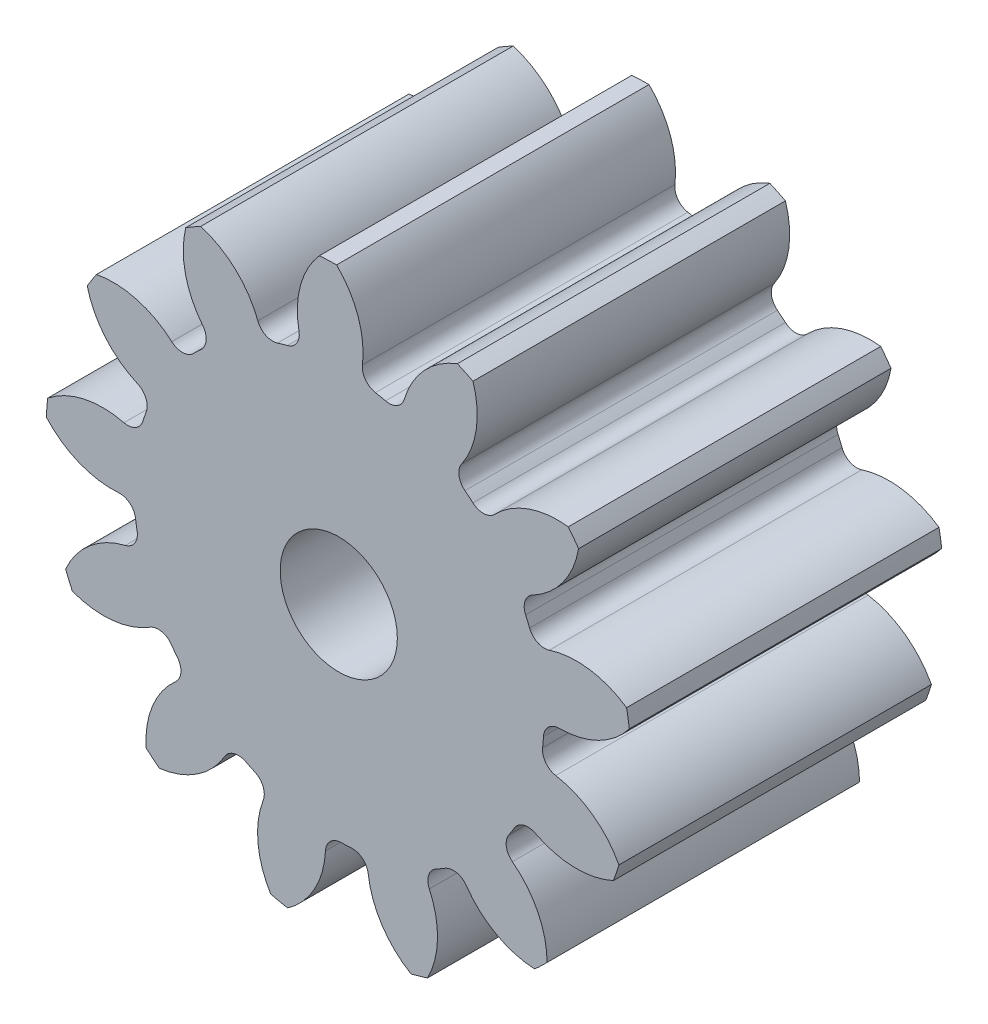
from build123d import *

# Parameters (mm, degrees)
SKETCH3_R         = 95.25
GEARBODY_DEPTH    = 101.6
TOOTHCUT_DEPTH    = 169.723694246
CIRPATTERN1_COUNT = 13
BOREDIA_R         = 19.05
BORE_DEPTH        = 12700


with BuildPart() as part:
    # Sketch3 → gearBody (new body)
    with BuildSketch(Plane.XY):
        Circle(SKETCH3_R)
    extrude(amount=GEARBODY_DEPTH)

    # Sketch2 → toothCut (cut, through all)
    with BuildSketch(Plane.XY):
        with BuildLine():
            ThreePointArc((66.278420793, -7.261305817), (66.439913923, -5.594056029), (66.55947366, -3.923275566))
            ThreePointArc((66.55947366, -3.923275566), (68.170701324, -0.46921317), (71.711403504, 0.941470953))
            ThreePointArc((71.711403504, 0.941470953), (84.98810038, 4.214647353), (95.25, 13.252223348))
            ThreePointArc((95.25, 13.252223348), (95.828406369, -8.068485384), (91.693127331, -28.992314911))
            ThreePointArc((91.693127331, -28.992314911), (83.086864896, -18.36609213), (70.544389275, -12.919013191))
            ThreePointArc((70.544389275, -12.919013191), (67.289414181, -10.936151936), (66.278420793, -7.261305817))
        make_face()
    toothcut = extrude(amount=TOOTHCUT_DEPTH, mode=Mode.SUBTRACT)

    # CirPattern1: toothCut ×13 about axis
    cirpattern1_axis = Axis((0, 0, 0), (0, 0, 1))
    for i in range(1, CIRPATTERN1_COUNT):
        add(toothcut.rotate(cirpattern1_axis, i * 360 / CIRPATTERN1_COUNT), mode=Mode.SUBTRACT)

    # boreDia → bore (cut, symmetric)
    with BuildSketch(Plane.XY):
        Circle(BOREDIA_R)
    extrude(amount=BORE_DEPTH, both=True, mode=Mode.SUBTRACT)


solid = part.part
